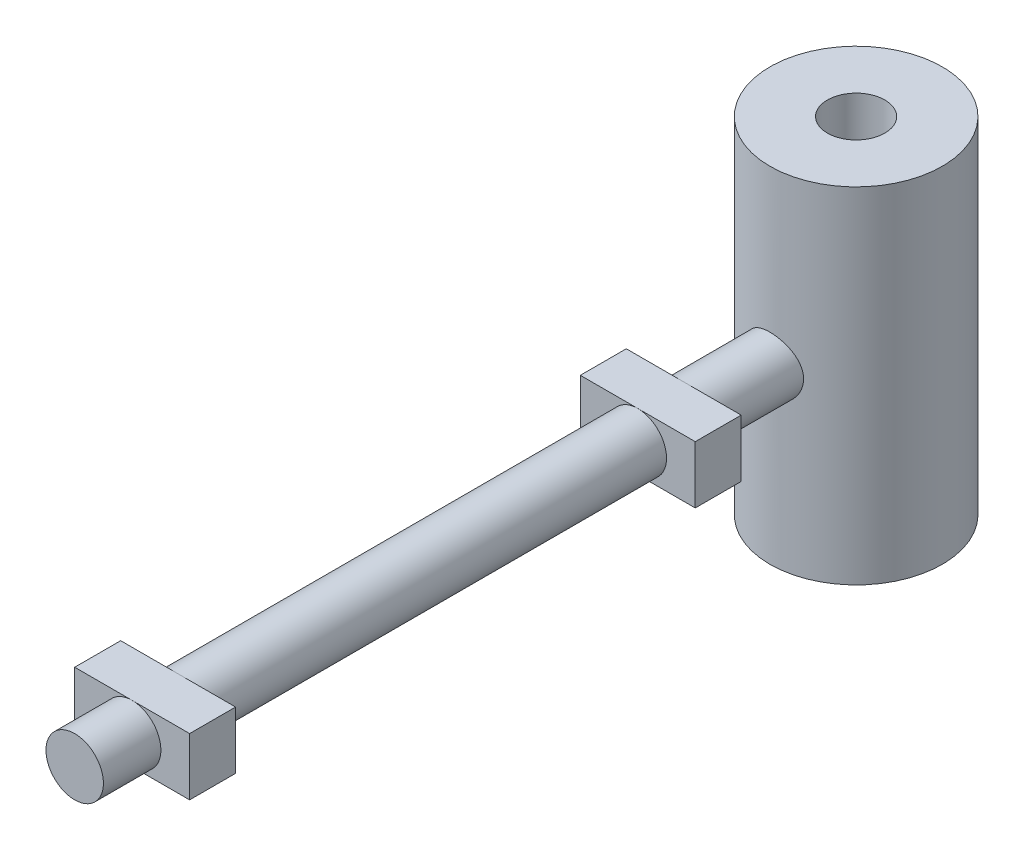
from build123d import *

# Parameters (mm, degrees)
ESQUISSE1_R             = 2.5
BASE_EXTRUSION_DEPTH    = 5
ESQUISSE2_W             = 10
ESQUISSE2_H             = 5
BOSS_EXTRU_1_DEPTH      = 4
BOSS_EXTRU_2_START      = 40
BOSS_EXTRU_2_DEPTH      = 40
ESQUISSE4_W             = 10
ESQUISSE4_H             = 5
BOSS_EXTRU_3_DEPTH      = 4
BOSS_EXTRU_4_START      = 15
BOSS_EXTRU_4_DEPTH      = 15
BOSS_EXTRU_5_DEPTH      = 15
BOSS_EXTRU_5_DEPTH_BACK = 15
ESQUISSE6_R             = 7.5
ESQUISSE7_R             = 2.5
ENL_V_MAT_EXTRU_1_DEPTH = 40


with BuildPart() as part:
    # Esquisse1 → Base-Extrusion (new body)
    with BuildSketch(Plane.XY):
        Circle(ESQUISSE1_R)
    extrude(amount=BASE_EXTRUSION_DEPTH)

    # Esquisse2 → Boss.-Extru.1 (add)
    with BuildSketch(Plane(origin=(0, 0, 0), x_dir=(-1, 0, 0), z_dir=(0, 0, -1))):
        Rectangle(ESQUISSE2_W, ESQUISSE2_H)
    extrude(amount=BOSS_EXTRU_1_DEPTH)

    # Esquisse3 → Boss.-Extru.2 (add)
    with BuildSketch(Plane(origin=(0, 0, -4), x_dir=(-1, 0, 0), z_dir=(0, 0, -1)).offset(BOSS_EXTRU_2_START)):
        with BuildLine():
            ThreePointArc((0, -2.5), (2.5, 0), (0, 2.5))
            ThreePointArc((0, 2.5), (-2.5, 0), (0, -2.5))
        make_face()
    extrude(amount=-BOSS_EXTRU_2_DEPTH)

    # Esquisse4 → Boss.-Extru.3 (add)
    with BuildSketch(Plane(origin=(0, 0, -44), x_dir=(-1, 0, 0), z_dir=(0, 0, -1))):
        Rectangle(ESQUISSE4_W, ESQUISSE4_H)
    extrude(amount=BOSS_EXTRU_3_DEPTH)

    # Esquisse5 → Boss.-Extru.4 (add)
    with BuildSketch(Plane(origin=(0, 0, -48), x_dir=(-1, 0, 0), z_dir=(0, 0, -1)).offset(BOSS_EXTRU_4_START)):
        with BuildLine():
            ThreePointArc((0, -2.5), (2.5, 0), (0, 2.5))
            ThreePointArc((0, 2.5), (-2.5, 0), (0, -2.5))
        make_face()
    extrude(amount=-BOSS_EXTRU_4_DEPTH)

    # Esquisse6 → Boss.-Extru.5 (add, two sides: drawn at the far end of the back side and taken through both)
    with BuildSketch(Plane(origin=(0, 0, 0), x_dir=(1, 0, 0), z_dir=(0, 1, 0)).offset(-BOSS_EXTRU_5_DEPTH_BACK)):
        with Locations(Location((0, 63, 0), (0, 0, 270))):
            Circle(ESQUISSE6_R)
    extrude(amount=BOSS_EXTRU_5_DEPTH + BOSS_EXTRU_5_DEPTH_BACK)

    # Esquisse7 → Enl_v. mat.-Extru.1 (cut)
    with BuildSketch(Plane(origin=(0, 15, 0), x_dir=(-1, 0, 0), z_dir=(0, 1, 0))):
        with Locations(Location((0, -63, 0), (0, 0, 90))):
            Circle(ESQUISSE7_R)
    extrude(amount=-ENL_V_MAT_EXTRU_1_DEPTH, mode=Mode.SUBTRACT)


solid = part.part
